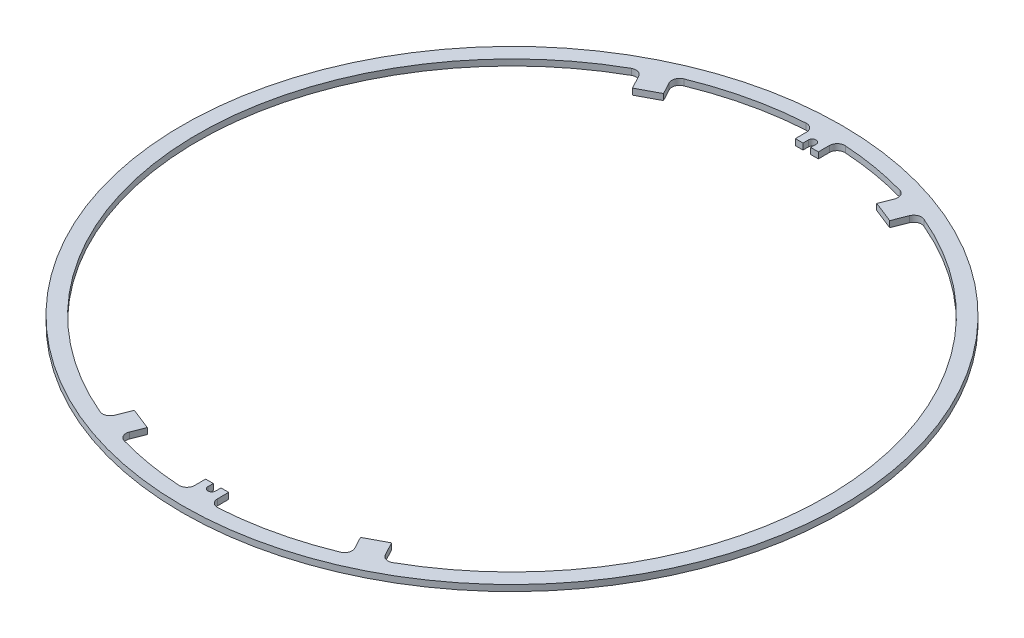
from build123d import *

# Parameters (mm, degrees)
SKETCH_1_R          = 43
SKETCH_1_R_2        = 41
EXTRUDE_1_DEPTH     = 0.8
EXTRUDE_START       = -0.8
EXTRUDE_2_DEPTH     = 0.8
FILLET_1_R          = 1
FILLET_2_R          = 1
CUT_EXTRUDE_1_DEPTH = 61.816445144
EXTRUDE_3_DEPTH     = 0.8
FILLET_3_R          = 1
EXTRUDE_5_DEPTH     = 0.8
FILLET_4_R          = 1


with BuildPart() as part:
    # Sketch 1 → Extrude 1 (new body)
    with BuildSketch(Plane(origin=(0, 0, 0), x_dir=(1, 0, 0), z_dir=(0, 1, 0))):
        with Locations(Location((0, 0, 0), (0, 0, 270))):
            Circle(SKETCH_1_R)
        with Locations(Location((0, 0, 0), (0, 0, 270))):
            Circle(SKETCH_1_R_2, mode=Mode.SUBTRACT)
    extrude(amount=EXTRUDE_1_DEPTH)

    # Sketch 2 → Extrude 2 (add)
    with BuildSketch(Plane(origin=(0, 0.8, 0), x_dir=(1, 0, 0), z_dir=(0, 1, 0)).offset(EXTRUDE_START)):
        with BuildLine():
            Line((-1.5, -38.472551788), (-1.5, -40.972551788))
            ThreePointArc((-1.5, -40.972551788), (0, -41), (1.5, -40.972551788))
            Line((1.5, -40.972551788), (1.5, -38.472551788))
            Line((1.5, -38.472551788), (-1.5, -38.472551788))
        make_face()
        with BuildLine():
            ThreePointArc((1.5, 40.972551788), (0, 41), (-1.5, 40.972551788))
            Line((-1.5, 40.972551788), (-1.5, 38.472551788))
            Line((-1.5, 38.472551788), (1.5, 38.472551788))
            Line((1.5, 38.472551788), (1.5, 40.972551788))
        make_face()
    extrude(amount=EXTRUDE_2_DEPTH)

    # Fillet 1
    fillet_1_edges = [part.edges().sort_by_distance(p)[0] for p in [
        (-1.5, 0.4, -40.972551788),
        (1.5, 0.4, -40.972551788),
    ]]
    fillet(fillet_1_edges, radius=FILLET_1_R)

    # Fillet 2
    fillet_2_edges = [part.edges().sort_by_distance(p)[0] for p in [
        (-1.5, 0.4, 40.972551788),
        (1.5, 0.4, 40.972551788),
    ]]
    fillet(fillet_2_edges, radius=FILLET_2_R)

    # Sketch 3 → Cut-Extrude 1 (cut, through all)
    with BuildSketch(Plane.XZ):
        with BuildLine():
            Line((-0.5, 39.172551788), (-0.5, 36.172551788))
            Line((-0.5, 36.172551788), (0.5, 36.172551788))
            Line((0.5, 36.172551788), (0.5, 39.172551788))
            ThreePointArc((0.5, 39.172551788), (0, 39.672551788), (-0.5, 39.172551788))
        make_face()
        with BuildLine():
            Line((0.5, -36.172551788), (0.5, -39.172551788))
            ThreePointArc((0.5, -39.172551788), (0, -39.672551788), (-0.5, -39.172551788))
            Line((-0.5, -39.172551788), (-0.5, -36.172551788))
            Line((-0.5, -36.172551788), (0.5, -36.172551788))
        make_face()
    extrude(amount=-CUT_EXTRUDE_1_DEPTH, mode=Mode.SUBTRACT)

    # Sketch 4 → Extrude 3 (add)
    with BuildSketch(Plane(origin=(0, 0.8, 0), x_dir=(1, 0, 0), z_dir=(0, 1, 0)).offset(EXTRUDE_START)):
        with BuildLine():
            Line((-15.026550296, -38.147120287), (-13.927046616, -35.355867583))
            Line((-13.927046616, -35.355867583), (-11.135793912, -36.455371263))
            Line((-11.135793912, -36.455371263), (-12.195017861, -39.144367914))
            ThreePointArc((-12.195017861, -39.144367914), (-13.619914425, -38.671668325), (-15.026550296, -38.147120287))
        make_face()
        with BuildLine():
            Line((15.026550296, 38.147120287), (13.927046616, 35.355867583))
            Line((13.927046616, 35.355867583), (11.135793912, 36.455371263))
            Line((11.135793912, 36.455371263), (12.195017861, 39.144367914))
            ThreePointArc((12.195017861, 39.144367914), (13.619914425, 38.671668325), (15.026550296, 38.147120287))
        make_face()
    extrude(amount=EXTRUDE_3_DEPTH)

    # Fillet 3
    fillet_3_edges = [part.edges().sort_by_distance(p)[0] for p in [
        (-12.195017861, 0.4, 39.144367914),
        (-15.026550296, 0.4, 38.147120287),
        (12.195017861, 0.4, -39.144367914),
        (15.026550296, 0.4, -38.147120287),
    ]]
    fillet(fillet_3_edges, radius=FILLET_3_R)

    # Sketch 5 → Extrude 5 (add)
    with BuildSketch(Plane.XZ):
        with BuildLine():
            Line((19.248334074, 36.200851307), (17.839919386, 33.552008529))
            Line((17.839919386, 33.552008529), (15.191076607, 34.960423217))
            Line((15.191076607, 34.960423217), (16.547894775, 37.512227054))
            ThreePointArc((16.547894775, 37.512227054), (17.910120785, 36.881263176), (19.248334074, 36.200851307))
        make_face()
        with BuildLine():
            Line((-17.839919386, -33.552008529), (-15.191076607, -34.960423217))
            Line((-15.191076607, -34.960423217), (-16.547894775, -37.512227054))
            ThreePointArc((-16.547894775, -37.512227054), (-17.910120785, -36.881263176), (-19.248334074, -36.200851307))
            Line((-19.248334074, -36.200851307), (-17.839919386, -33.552008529))
        make_face()
    extrude(amount=-EXTRUDE_5_DEPTH)

    # Fillet 4
    fillet_4_edges = [part.edges().sort_by_distance(p)[0] for p in [
        (19.248334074, 0.4, 36.200851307),
        (16.547894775, 0.4, 37.512227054),
        (-19.248334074, 0.4, -36.200851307),
        (-16.547894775, 0.4, -37.512227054),
    ]]
    fillet(fillet_4_edges, radius=FILLET_4_R)


solid = part.part
